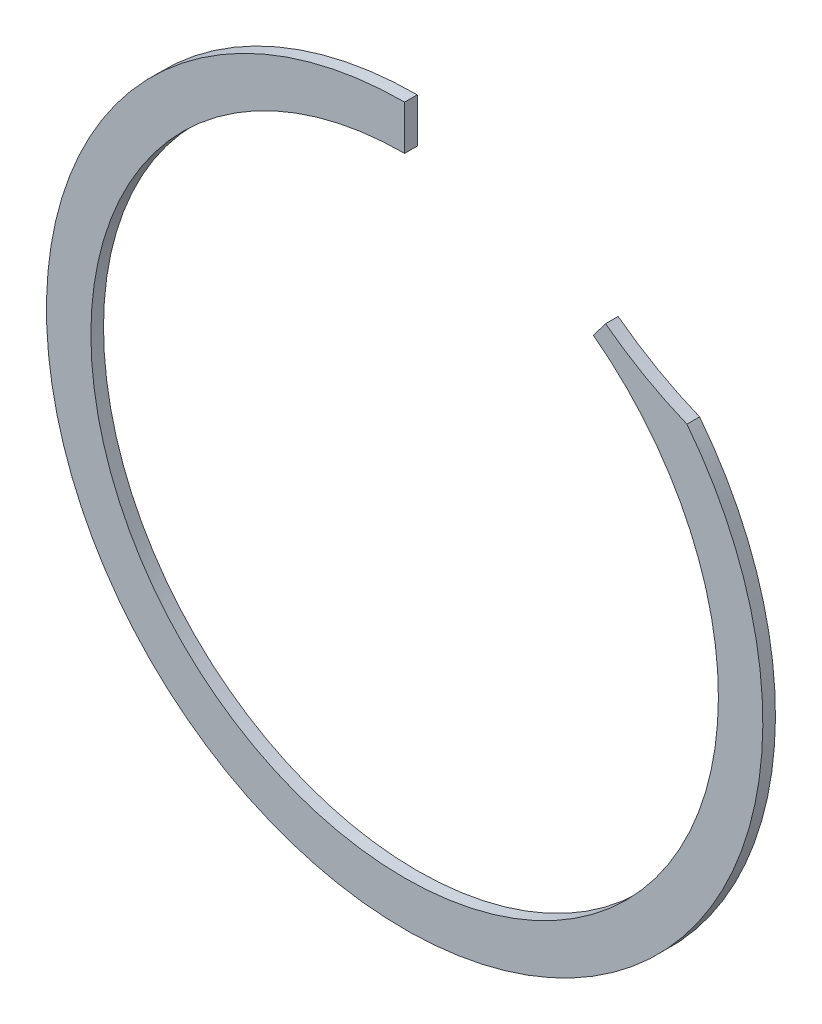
ISO-10303-21;
HEADER;
FILE_DESCRIPTION(('STEP AP214'),'2;1');
FILE_NAME('part.step','',(''),(''),'','','');
FILE_SCHEMA(('AUTOMOTIVE_DESIGN { 1 0 10303 214 1 1 1 1 }'));
ENDSEC;
DATA;
#1=APPLICATION_CONTEXT('core data for automotive mechanical design processes');
#2=APPLICATION_PROTOCOL_DEFINITION('international standard','automotive_design',2000,#1);
#3=PRODUCT_CONTEXT('',#1,'mechanical');
#4=PRODUCT('Part','Part','',(#3));
#5=PRODUCT_RELATED_PRODUCT_CATEGORY('part','',(#4));
#6=PRODUCT_DEFINITION_FORMATION('','',#4);
#7=PRODUCT_DEFINITION_CONTEXT('part definition',#1,'design');
#8=PRODUCT_DEFINITION('design','',#6,#7);
#9=PRODUCT_DEFINITION_SHAPE('','',#8);
#10=(LENGTH_UNIT() NAMED_UNIT(*) SI_UNIT(.MILLI.,.METRE.));
#11=(NAMED_UNIT(*) PLANE_ANGLE_UNIT() SI_UNIT($,.RADIAN.));
#12=(NAMED_UNIT(*) SI_UNIT($,.STERADIAN.) SOLID_ANGLE_UNIT());
#13=UNCERTAINTY_MEASURE_WITH_UNIT(LENGTH_MEASURE(1.E-05),#10,'distance_accuracy_value','');
#14=(GEOMETRIC_REPRESENTATION_CONTEXT(3) GLOBAL_UNCERTAINTY_ASSIGNED_CONTEXT((#13)) GLOBAL_UNIT_ASSIGNED_CONTEXT((#10,
#11,#12)) REPRESENTATION_CONTEXT('',''));
#15=CARTESIAN_POINT('',(0.,0.,0.));
#16=DIRECTION('',(0.,0.,1.));
#17=DIRECTION('',(1.,0.,0.));
#18=AXIS2_PLACEMENT_3D('',#15,#16,#17);
#19=CARTESIAN_POINT('',(0.,0.,0.635));
#20=DIRECTION('',(0.,0.,1.));
#21=DIRECTION('',(1.,0.,0.));
#22=AXIS2_PLACEMENT_3D('',#19,#20,#21);
#23=PLANE('',#22);
#24=CARTESIAN_POINT('',(21.1326138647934,28.0533454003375,0.635));
#25=DIRECTION('',(0.,0.,1.));
#26=DIRECTION('',(1.,0.,0.));
#27=AXIS2_PLACEMENT_3D('',#24,#25,#26);
#28=CIRCLE('',#27,18.3229470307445);
#29=CARTESIAN_POINT('',(10.1079510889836,13.4182096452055,0.635));
#30=VERTEX_POINT('',#29);
#31=CARTESIAN_POINT('',(14.2042929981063,11.0907760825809,0.635));
#32=VERTEX_POINT('',#31);
#33=EDGE_CURVE('E101',#30,#32,#28,.T.);
#34=ORIENTED_EDGE('',*,*,#33,.F.);
#35=DIRECTION('',(0.601686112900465,0.798732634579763,0.));
#36=VECTOR('',#35,1.);
#37=CARTESIAN_POINT('',(0.,0.,0.635));
#38=LINE('',#37,#36);
#39=CARTESIAN_POINT('',(9.49827714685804,12.6088732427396,0.635));
#40=VERTEX_POINT('',#39);
#41=EDGE_CURVE('E89',#40,#30,#38,.T.);
#42=ORIENTED_EDGE('',*,*,#41,.F.);
#43=CARTESIAN_POINT('',(0.,0.,0.635));
#44=DIRECTION('',(0.,0.,1.));
#45=DIRECTION('',(1.,0.,0.));
#46=AXIS2_PLACEMENT_3D('',#43,#44,#45);
#47=CIRCLE('',#46,15.7861);
#48=CARTESIAN_POINT('',(0.,15.7861,0.635));
#49=VERTEX_POINT('',#48);
#50=EDGE_CURVE('E107',#49,#40,#47,.T.);
#51=ORIENTED_EDGE('',*,*,#50,.F.);
#52=DIRECTION('',(0.,-1.,0.));
#53=VECTOR('',#52,1.);
#54=CARTESIAN_POINT('',(0.,0.,0.635));
#55=LINE('',#54,#53);
#56=CARTESIAN_POINT('',(0.,18.0213,0.635));
#57=VERTEX_POINT('',#56);
#58=EDGE_CURVE('E53',#57,#49,#55,.T.);
#59=ORIENTED_EDGE('',*,*,#58,.F.);
#60=CARTESIAN_POINT('',(0.,0.,0.635));
#61=DIRECTION('',(0.,0.,1.));
#62=DIRECTION('',(1.,0.,0.));
#63=AXIS2_PLACEMENT_3D('',#60,#61,#62);
#64=CIRCLE('',#63,18.0213);
#65=EDGE_CURVE('E112',#57,#32,#64,.T.);
#66=ORIENTED_EDGE('',*,*,#65,.T.);
#67=EDGE_LOOP('',(#34,#42,#51,#59,#66));
#68=FACE_BOUND('',#67,.T.);
#69=ADVANCED_FACE('F30',(#68),#23,.T.);
#70=CARTESIAN_POINT('',(0.,0.,0.));
#71=DIRECTION('',(0.,0.,1.));
#72=DIRECTION('',(1.,0.,0.));
#73=AXIS2_PLACEMENT_3D('',#70,#71,#72);
#74=PLANE('',#73);
#75=DIRECTION('',(0.601686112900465,0.798732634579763,0.));
#76=VECTOR('',#75,1.);
#77=CARTESIAN_POINT('',(0.,0.,0.));
#78=LINE('',#77,#76);
#79=CARTESIAN_POINT('',(9.49827714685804,12.6088732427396,0.));
#80=VERTEX_POINT('',#79);
#81=CARTESIAN_POINT('',(10.1079510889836,13.4182096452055,0.));
#82=VERTEX_POINT('',#81);
#83=EDGE_CURVE('E45',#80,#82,#78,.T.);
#84=ORIENTED_EDGE('',*,*,#83,.T.);
#85=CARTESIAN_POINT('',(21.1326138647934,28.0533454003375,0.));
#86=DIRECTION('',(0.,0.,1.));
#87=DIRECTION('',(1.,0.,0.));
#88=AXIS2_PLACEMENT_3D('',#85,#86,#87);
#89=CIRCLE('',#88,18.3229470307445);
#90=CARTESIAN_POINT('',(14.2042929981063,11.0907760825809,0.));
#91=VERTEX_POINT('',#90);
#92=EDGE_CURVE('E77',#82,#91,#89,.T.);
#93=ORIENTED_EDGE('',*,*,#92,.T.);
#94=CARTESIAN_POINT('',(0.,0.,0.));
#95=DIRECTION('',(0.,0.,1.));
#96=DIRECTION('',(1.,0.,0.));
#97=AXIS2_PLACEMENT_3D('',#94,#95,#96);
#98=CIRCLE('',#97,18.0213);
#99=CARTESIAN_POINT('',(0.,18.0213,0.));
#100=VERTEX_POINT('',#99);
#101=EDGE_CURVE('E110',#100,#91,#98,.T.);
#102=ORIENTED_EDGE('',*,*,#101,.F.);
#103=DIRECTION('',(0.,-1.,0.));
#104=VECTOR('',#103,1.);
#105=CARTESIAN_POINT('',(0.,0.,0.));
#106=LINE('',#105,#104);
#107=CARTESIAN_POINT('',(0.,15.7861,0.));
#108=VERTEX_POINT('',#107);
#109=EDGE_CURVE('E85',#100,#108,#106,.T.);
#110=ORIENTED_EDGE('',*,*,#109,.T.);
#111=CARTESIAN_POINT('',(0.,0.,0.));
#112=DIRECTION('',(0.,0.,1.));
#113=DIRECTION('',(1.,0.,0.));
#114=AXIS2_PLACEMENT_3D('',#111,#112,#113);
#115=CIRCLE('',#114,15.7861);
#116=EDGE_CURVE('E90',#108,#80,#115,.T.);
#117=ORIENTED_EDGE('',*,*,#116,.T.);
#118=EDGE_LOOP('',(#84,#93,#102,#110,#117));
#119=FACE_BOUND('',#118,.T.);
#120=ADVANCED_FACE('F94',(#119),#74,.F.);
#121=CARTESIAN_POINT('',(0.,0.,0.635));
#122=DIRECTION('',(0.,0.,-1.));
#123=DIRECTION('',(-1.,0.,0.));
#124=AXIS2_PLACEMENT_3D('',#121,#122,#123);
#125=CYLINDRICAL_SURFACE('',#124,18.0213);
#126=DIRECTION('',(0.,0.,-1.));
#127=VECTOR('',#126,1.);
#128=CARTESIAN_POINT('',(14.2042929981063,11.0907760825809,0.3175));
#129=LINE('',#128,#127);
#130=EDGE_CURVE('E11',#32,#91,#129,.T.);
#131=ORIENTED_EDGE('',*,*,#130,.F.);
#132=ORIENTED_EDGE('',*,*,#65,.F.);
#133=DIRECTION('',(0.,0.,-1.));
#134=VECTOR('',#133,1.);
#135=CARTESIAN_POINT('',(0.,18.0213,0.635));
#136=LINE('',#135,#134);
#137=EDGE_CURVE('E91',#57,#100,#136,.T.);
#138=ORIENTED_EDGE('',*,*,#137,.T.);
#139=ORIENTED_EDGE('',*,*,#101,.T.);
#140=EDGE_LOOP('',(#131,#132,#138,#139));
#141=FACE_BOUND('',#140,.T.);
#142=ADVANCED_FACE('F32',(#141),#125,.T.);
#143=CARTESIAN_POINT('',(0.,0.,0.635));
#144=DIRECTION('',(0.,0.,-1.));
#145=DIRECTION('',(-1.,0.,0.));
#146=AXIS2_PLACEMENT_3D('',#143,#144,#145);
#147=CYLINDRICAL_SURFACE('',#146,15.7861);
#148=ORIENTED_EDGE('',*,*,#50,.T.);
#149=DIRECTION('',(0.,0.,-1.));
#150=VECTOR('',#149,1.);
#151=CARTESIAN_POINT('',(9.49827714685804,12.6088732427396,0.635));
#152=LINE('',#151,#150);
#153=EDGE_CURVE('E38',#40,#80,#152,.T.);
#154=ORIENTED_EDGE('',*,*,#153,.T.);
#155=ORIENTED_EDGE('',*,*,#116,.F.);
#156=DIRECTION('',(0.,0.,-1.));
#157=VECTOR('',#156,1.);
#158=CARTESIAN_POINT('',(0.,15.7861,0.635));
#159=LINE('',#158,#157);
#160=EDGE_CURVE('E115',#108,#49,#159,.F.);
#161=ORIENTED_EDGE('',*,*,#160,.T.);
#162=EDGE_LOOP('',(#148,#154,#155,#161));
#163=FACE_BOUND('',#162,.T.);
#164=ADVANCED_FACE('F117',(#163),#147,.F.);
#165=CARTESIAN_POINT('',(0.,0.,0.635));
#166=DIRECTION('',(1.,0.,0.));
#167=DIRECTION('',(0.,0.,-1.));
#168=AXIS2_PLACEMENT_3D('',#165,#166,#167);
#169=PLANE('',#168);
#170=ORIENTED_EDGE('',*,*,#109,.F.);
#171=ORIENTED_EDGE('',*,*,#137,.F.);
#172=ORIENTED_EDGE('',*,*,#58,.T.);
#173=ORIENTED_EDGE('',*,*,#160,.F.);
#174=EDGE_LOOP('',(#170,#171,#172,#173));
#175=FACE_BOUND('',#174,.T.);
#176=ADVANCED_FACE('F122',(#175),#169,.T.);
#177=CARTESIAN_POINT('',(21.1326138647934,28.0533454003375,0.635));
#178=DIRECTION('',(0.,0.,-1.));
#179=DIRECTION('',(-1.,0.,0.));
#180=AXIS2_PLACEMENT_3D('',#177,#178,#179);
#181=CYLINDRICAL_SURFACE('',#180,18.3229470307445);
#182=ORIENTED_EDGE('',*,*,#130,.T.);
#183=ORIENTED_EDGE('',*,*,#92,.F.);
#184=DIRECTION('',(0.,0.,-1.));
#185=VECTOR('',#184,1.);
#186=CARTESIAN_POINT('',(10.1079510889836,13.4182096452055,0.635));
#187=LINE('',#186,#185);
#188=EDGE_CURVE('E79',#30,#82,#187,.T.);
#189=ORIENTED_EDGE('',*,*,#188,.F.);
#190=ORIENTED_EDGE('',*,*,#33,.T.);
#191=EDGE_LOOP('',(#182,#183,#189,#190));
#192=FACE_BOUND('',#191,.T.);
#193=ADVANCED_FACE('F78',(#192),#181,.F.);
#194=CARTESIAN_POINT('',(0.,0.,0.635));
#195=DIRECTION('',(-0.798732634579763,0.601686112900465,0.));
#196=DIRECTION('',(-0.601686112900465,-0.798732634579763,0.));
#197=AXIS2_PLACEMENT_3D('',#194,#195,#196);
#198=PLANE('',#197);
#199=ORIENTED_EDGE('',*,*,#41,.T.);
#200=ORIENTED_EDGE('',*,*,#188,.T.);
#201=ORIENTED_EDGE('',*,*,#83,.F.);
#202=ORIENTED_EDGE('',*,*,#153,.F.);
#203=EDGE_LOOP('',(#199,#200,#201,#202));
#204=FACE_BOUND('',#203,.T.);
#205=ADVANCED_FACE('F87',(#204),#198,.T.);
#206=CLOSED_SHELL('',(#69,#120,#142,#164,#176,#193,#205));
#207=MANIFOLD_SOLID_BREP('B2',#206);
#208=ADVANCED_BREP_SHAPE_REPRESENTATION('',(#18,#207),#14);
#209=SHAPE_DEFINITION_REPRESENTATION(#9,#208);
ENDSEC;
END-ISO-10303-21;
